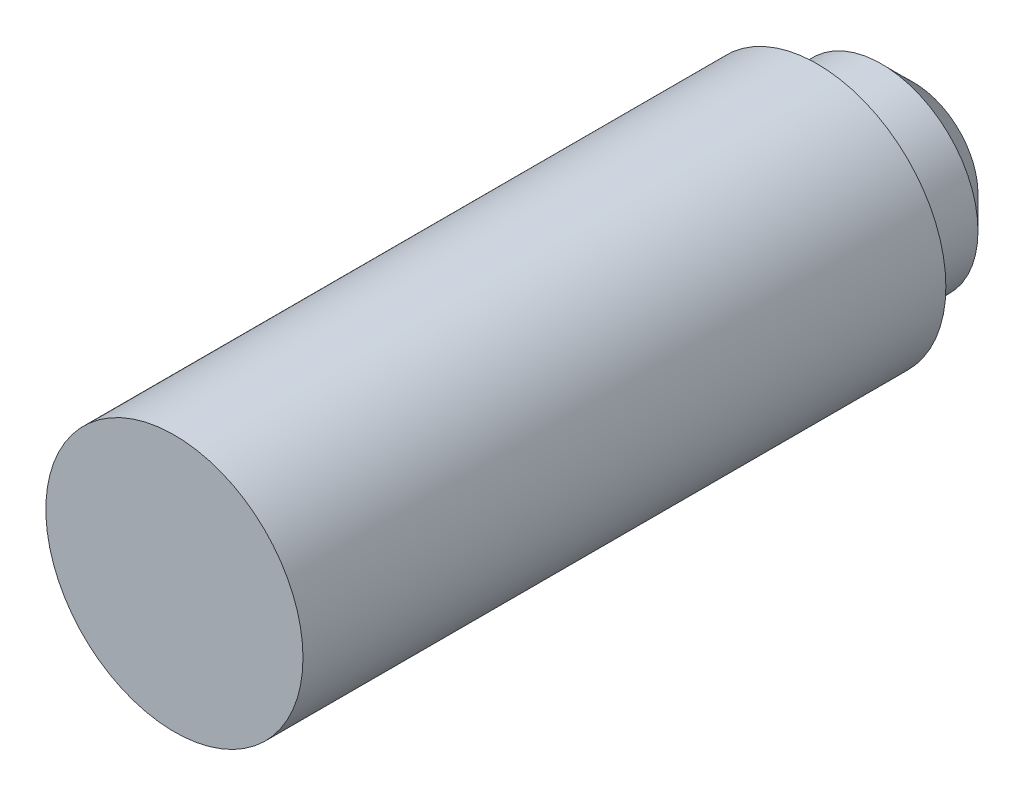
from build123d import *

# Parameters (mm, degrees)
ESQUISSE1_R        = 3
BOSS_EXTRU_1_DEPTH = 3
ESQUISSE2_R        = 4
BOSS_EXTRU_2_DEPTH = 20
CHANFREIN1_SIZE    = 1


with BuildPart() as part:
    # Esquisse1 → Boss.-Extru.1 (new body)
    with BuildSketch(Plane.XY):
        Circle(ESQUISSE1_R)
    extrude(amount=BOSS_EXTRU_1_DEPTH)

    # Esquisse2 → Boss.-Extru.2 (add)
    with BuildSketch(Plane.XY.offset(3)):
        Circle(ESQUISSE2_R)
    extrude(amount=BOSS_EXTRU_2_DEPTH)

    # Chanfrein1
    chanfrein1_edges = [part.edges().sort_by_distance(p)[0] for p in [
        (-3, 0, 0),
    ]]
    chamfer(chanfrein1_edges, length=CHANFREIN1_SIZE)


solid = part.part
